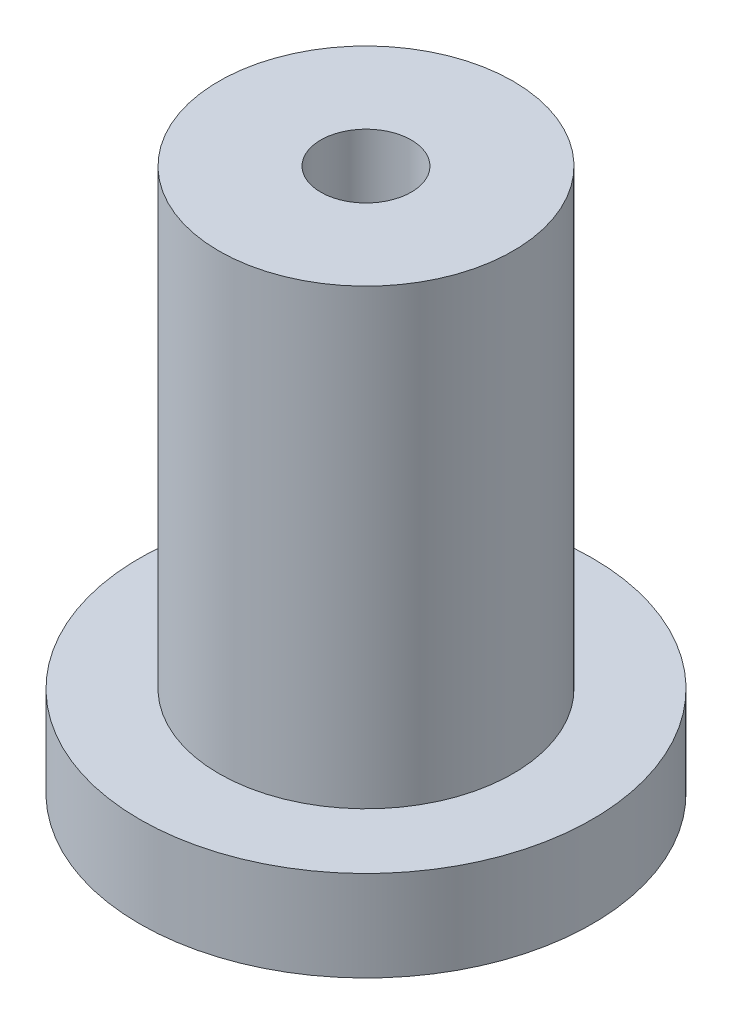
from build123d import *

# Parameters (mm, degrees)
SKETCH_1_R          = 5
EXTRUDE_1_DEPTH     = 2
SKETCH_2_R          = 3.25
EXTRUDE_2_DEPTH     = 10
SKETCH_3_R          = 1
CUT_EXTRUDE_1_DEPTH = 3


with BuildPart() as part:
    # Sketch 1 → Extrude 1 (new body)
    with BuildSketch(Plane(origin=(0, 0, 0), x_dir=(1, 0, 0), z_dir=(0, 1, 0))):
        with Locations(Location((0, 0, 0), (0, 0, 270))):
            Circle(SKETCH_1_R)
    extrude(amount=EXTRUDE_1_DEPTH)

    # Sketch 2 → Extrude 2 (add)
    with BuildSketch(Plane(origin=(0, 2, 0), x_dir=(1, 0, 0), z_dir=(0, 1, 0))):
        with Locations(Location((0, 0, 0), (0, 0, 270))):
            Circle(SKETCH_2_R)
    extrude(amount=EXTRUDE_2_DEPTH)

    # Sketch 3 → Cut-Extrude 1 (cut)
    with BuildSketch(Plane(origin=(0, 12, 0), x_dir=(1, 0, 0), z_dir=(0, 1, 0))):
        with Locations(Location((0, 0, 0), (0, 0, 270))):
            Circle(SKETCH_3_R)
    extrude(amount=-CUT_EXTRUDE_1_DEPTH, mode=Mode.SUBTRACT)


solid = part.part
